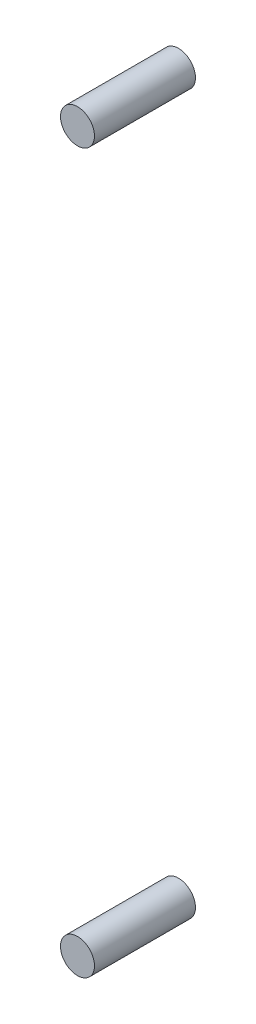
ISO-10303-21;
HEADER;
FILE_DESCRIPTION(('STEP AP214'),'2;1');
FILE_NAME('part.step','',(''),(''),'','','');
FILE_SCHEMA(('AUTOMOTIVE_DESIGN { 1 0 10303 214 1 1 1 1 }'));
ENDSEC;
DATA;
#1=APPLICATION_CONTEXT('core data for automotive mechanical design processes');
#2=APPLICATION_PROTOCOL_DEFINITION('international standard','automotive_design',2000,#1);
#3=PRODUCT_CONTEXT('',#1,'mechanical');
#4=PRODUCT('Part','Part','',(#3));
#5=PRODUCT_RELATED_PRODUCT_CATEGORY('part','',(#4));
#6=PRODUCT_DEFINITION_FORMATION('','',#4);
#7=PRODUCT_DEFINITION_CONTEXT('part definition',#1,'design');
#8=PRODUCT_DEFINITION('design','',#6,#7);
#9=PRODUCT_DEFINITION_SHAPE('','',#8);
#10=(LENGTH_UNIT() NAMED_UNIT(*) SI_UNIT(.MILLI.,.METRE.));
#11=(NAMED_UNIT(*) PLANE_ANGLE_UNIT() SI_UNIT($,.RADIAN.));
#12=(NAMED_UNIT(*) SI_UNIT($,.STERADIAN.) SOLID_ANGLE_UNIT());
#13=UNCERTAINTY_MEASURE_WITH_UNIT(LENGTH_MEASURE(1.E-05),#10,'distance_accuracy_value','');
#14=(GEOMETRIC_REPRESENTATION_CONTEXT(3) GLOBAL_UNCERTAINTY_ASSIGNED_CONTEXT((#13)) GLOBAL_UNIT_ASSIGNED_CONTEXT((#10,
#11,#12)) REPRESENTATION_CONTEXT('',''));
#15=CARTESIAN_POINT('',(0.,0.,0.));
#16=DIRECTION('',(0.,0.,1.));
#17=DIRECTION('',(1.,0.,0.));
#18=AXIS2_PLACEMENT_3D('',#15,#16,#17);
#19=CARTESIAN_POINT('',(-41.0512459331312,-1316.5,-104.));
#20=DIRECTION('',(0.,0.,-1.));
#21=DIRECTION('',(0.,1.,0.));
#22=AXIS2_PLACEMENT_3D('',#19,#20,#21);
#23=PLANE('',#22);
#24=CARTESIAN_POINT('',(25.,91.5000000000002,-104.));
#25=DIRECTION('',(0.,0.,-1.));
#26=DIRECTION('',(-1.,0.,0.));
#27=AXIS2_PLACEMENT_3D('',#24,#25,#26);
#28=CIRCLE('',#27,17.5);
#29=CARTESIAN_POINT('',(7.49999999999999,91.5000000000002,-104.));
#30=VERTEX_POINT('',#29);
#31=EDGE_CURVE('E11',#30,#30,#28,.F.);
#32=ORIENTED_EDGE('',*,*,#31,.F.);
#33=EDGE_LOOP('',(#32));
#34=FACE_BOUND('',#33,.T.);
#35=ADVANCED_FACE('F36',(#34),#23,.T.);
#36=CARTESIAN_POINT('',(25.,91.5000000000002,0.));
#37=DIRECTION('',(0.,0.,1.));
#38=DIRECTION('',(1.,0.,0.));
#39=AXIS2_PLACEMENT_3D('',#36,#37,#38);
#40=PLANE('',#39);
#41=CARTESIAN_POINT('',(25.,91.5000000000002,0.));
#42=DIRECTION('',(0.,0.,1.));
#43=DIRECTION('',(1.,0.,0.));
#44=AXIS2_PLACEMENT_3D('',#41,#42,#43);
#45=CIRCLE('',#44,17.5);
#46=CARTESIAN_POINT('',(42.5,91.5000000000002,0.));
#47=VERTEX_POINT('',#46);
#48=EDGE_CURVE('E42',#47,#47,#45,.T.);
#49=ORIENTED_EDGE('',*,*,#48,.T.);
#50=EDGE_LOOP('',(#49));
#51=FACE_BOUND('',#50,.T.);
#52=ADVANCED_FACE('F48',(#51),#40,.T.);
#53=CARTESIAN_POINT('',(25.,91.5000000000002,-153.497474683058));
#54=DIRECTION('',(0.,0.,1.));
#55=DIRECTION('',(1.,0.,0.));
#56=AXIS2_PLACEMENT_3D('',#53,#54,#55);
#57=CYLINDRICAL_SURFACE('',#56,17.5);
#58=ORIENTED_EDGE('',*,*,#48,.F.);
#59=EDGE_LOOP('',(#58));
#60=FACE_BOUND('',#59,.T.);
#61=ORIENTED_EDGE('',*,*,#31,.T.);
#62=EDGE_LOOP('',(#61));
#63=FACE_BOUND('',#62,.T.);
#64=ADVANCED_FACE('F50',(#60,#63),#57,.T.);
#65=CLOSED_SHELL('',(#35,#52,#64));
#66=MANIFOLD_SOLID_BREP('B2',#65);
#67=CARTESIAN_POINT('',(-41.0512459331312,-1316.5,-104.));
#68=DIRECTION('',(0.,0.,-1.));
#69=DIRECTION('',(0.,1.,0.));
#70=AXIS2_PLACEMENT_3D('',#67,#68,#69);
#71=PLANE('',#70);
#72=CARTESIAN_POINT('',(25.,831.5,-104.));
#73=DIRECTION('',(0.,0.,-1.));
#74=DIRECTION('',(-1.,0.,0.));
#75=AXIS2_PLACEMENT_3D('',#72,#73,#74);
#76=CIRCLE('',#75,17.5);
#77=CARTESIAN_POINT('',(7.49999999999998,831.5,-104.));
#78=VERTEX_POINT('',#77);
#79=EDGE_CURVE('E35',#78,#78,#76,.F.);
#80=ORIENTED_EDGE('',*,*,#79,.F.);
#81=EDGE_LOOP('',(#80));
#82=FACE_BOUND('',#81,.T.);
#83=ADVANCED_FACE('F76',(#82),#71,.T.);
#84=CARTESIAN_POINT('',(25.,831.5,0.));
#85=DIRECTION('',(0.,0.,1.));
#86=DIRECTION('',(1.,0.,0.));
#87=AXIS2_PLACEMENT_3D('',#84,#85,#86);
#88=PLANE('',#87);
#89=CARTESIAN_POINT('',(25.,831.5,0.));
#90=DIRECTION('',(0.,0.,1.));
#91=DIRECTION('',(1.,0.,0.));
#92=AXIS2_PLACEMENT_3D('',#89,#90,#91);
#93=CIRCLE('',#92,17.5);
#94=CARTESIAN_POINT('',(42.5,831.5,0.));
#95=VERTEX_POINT('',#94);
#96=EDGE_CURVE('E82',#95,#95,#93,.T.);
#97=ORIENTED_EDGE('',*,*,#96,.T.);
#98=EDGE_LOOP('',(#97));
#99=FACE_BOUND('',#98,.T.);
#100=ADVANCED_FACE('F88',(#99),#88,.T.);
#101=CARTESIAN_POINT('',(25.,831.5,-153.497474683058));
#102=DIRECTION('',(0.,0.,1.));
#103=DIRECTION('',(1.,0.,0.));
#104=AXIS2_PLACEMENT_3D('',#101,#102,#103);
#105=CYLINDRICAL_SURFACE('',#104,17.5);
#106=ORIENTED_EDGE('',*,*,#96,.F.);
#107=EDGE_LOOP('',(#106));
#108=FACE_BOUND('',#107,.T.);
#109=ORIENTED_EDGE('',*,*,#79,.T.);
#110=EDGE_LOOP('',(#109));
#111=FACE_BOUND('',#110,.T.);
#112=ADVANCED_FACE('F90',(#108,#111),#105,.T.);
#113=CLOSED_SHELL('',(#83,#100,#112));
#114=MANIFOLD_SOLID_BREP('B6',#113);
#115=ADVANCED_BREP_SHAPE_REPRESENTATION('',(#18,#66,#114),#14);
#116=SHAPE_DEFINITION_REPRESENTATION(#9,#115);
ENDSEC;
END-ISO-10303-21;
